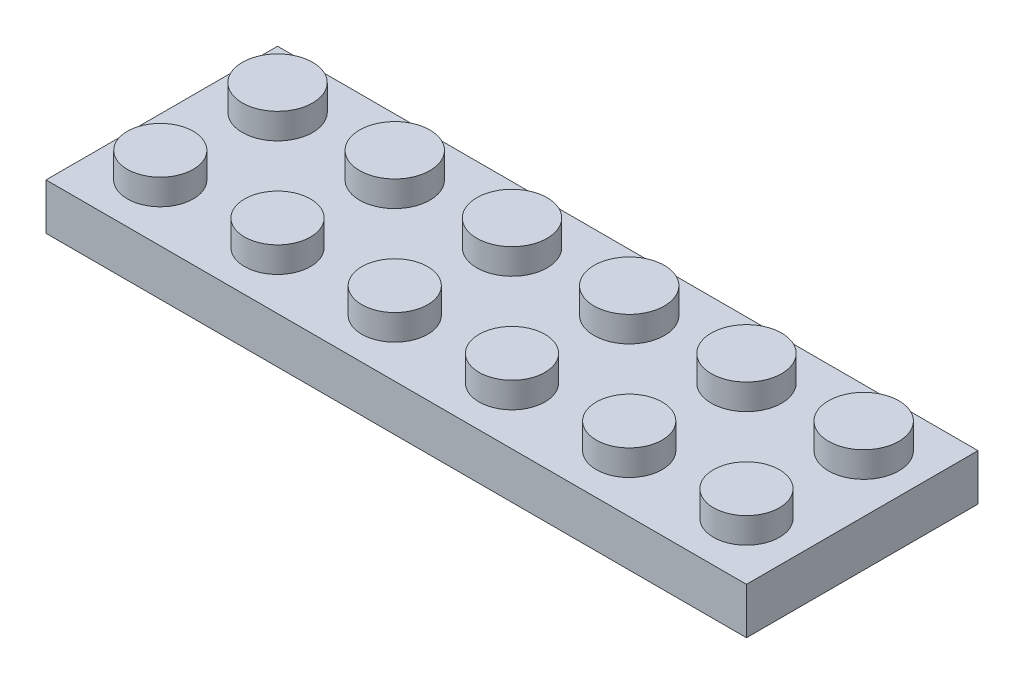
ISO-10303-21;
HEADER;
FILE_DESCRIPTION(('STEP AP214'),'2;1');
FILE_NAME('part.step','',(''),(''),'','','');
FILE_SCHEMA(('AUTOMOTIVE_DESIGN { 1 0 10303 214 1 1 1 1 }'));
ENDSEC;
DATA;
#1=APPLICATION_CONTEXT('core data for automotive mechanical design processes');
#2=APPLICATION_PROTOCOL_DEFINITION('international standard','automotive_design',2000,#1);
#3=PRODUCT_CONTEXT('',#1,'mechanical');
#4=PRODUCT('Part','Part','',(#3));
#5=PRODUCT_RELATED_PRODUCT_CATEGORY('part','',(#4));
#6=PRODUCT_DEFINITION_FORMATION('','',#4);
#7=PRODUCT_DEFINITION_CONTEXT('part definition',#1,'design');
#8=PRODUCT_DEFINITION('design','',#6,#7);
#9=PRODUCT_DEFINITION_SHAPE('','',#8);
#10=(LENGTH_UNIT() NAMED_UNIT(*) SI_UNIT(.MILLI.,.METRE.));
#11=(NAMED_UNIT(*) PLANE_ANGLE_UNIT() SI_UNIT($,.RADIAN.));
#12=(NAMED_UNIT(*) SI_UNIT($,.STERADIAN.) SOLID_ANGLE_UNIT());
#13=UNCERTAINTY_MEASURE_WITH_UNIT(LENGTH_MEASURE(1.E-05),#10,'distance_accuracy_value','');
#14=(GEOMETRIC_REPRESENTATION_CONTEXT(3) GLOBAL_UNCERTAINTY_ASSIGNED_CONTEXT((#13)) GLOBAL_UNIT_ASSIGNED_CONTEXT((#10,
#11,#12)) REPRESENTATION_CONTEXT('',''));
#15=CARTESIAN_POINT('',(0.,0.,0.));
#16=DIRECTION('',(0.,0.,1.));
#17=DIRECTION('',(1.,0.,0.));
#18=AXIS2_PLACEMENT_3D('',#15,#16,#17);
#19=CARTESIAN_POINT('',(-23.4,2.5,7.4));
#20=DIRECTION('',(0.,-1.,0.));
#21=DIRECTION('',(0.,0.,-1.));
#22=AXIS2_PLACEMENT_3D('',#19,#20,#21);
#23=PLANE('',#22);
#24=CARTESIAN_POINT('',(-8.10000000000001,2.5,0.));
#25=DIRECTION('',(0.,-1.,0.));
#26=DIRECTION('',(0.,0.,-1.));
#27=AXIS2_PLACEMENT_3D('',#24,#25,#26);
#28=CIRCLE('',#27,3.4);
#29=CARTESIAN_POINT('',(-8.10000000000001,2.5,-3.4));
#30=VERTEX_POINT('',#29);
#31=EDGE_CURVE('E451',#30,#30,#28,.T.);
#32=ORIENTED_EDGE('',*,*,#31,.F.);
#33=EDGE_LOOP('',(#32));
#34=FACE_BOUND('',#33,.T.);
#35=CARTESIAN_POINT('',(7.89999999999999,2.5,0.));
#36=DIRECTION('',(0.,-1.,0.));
#37=DIRECTION('',(0.,0.,-1.));
#38=AXIS2_PLACEMENT_3D('',#35,#36,#37);
#39=CIRCLE('',#38,3.4);
#40=CARTESIAN_POINT('',(7.89999999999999,2.5,-3.4));
#41=VERTEX_POINT('',#40);
#42=EDGE_CURVE('E416',#41,#41,#39,.T.);
#43=ORIENTED_EDGE('',*,*,#42,.F.);
#44=EDGE_LOOP('',(#43));
#45=FACE_BOUND('',#44,.T.);
#46=DIRECTION('',(0.,0.,-1.));
#47=VECTOR('',#46,1.);
#48=CARTESIAN_POINT('',(-23.4,2.5,-7.4));
#49=LINE('',#48,#47);
#50=CARTESIAN_POINT('',(-23.4,2.5,7.4));
#51=VERTEX_POINT('',#50);
#52=CARTESIAN_POINT('',(-23.4,2.5,-7.4));
#53=VERTEX_POINT('',#52);
#54=EDGE_CURVE('E114',#51,#53,#49,.T.);
#55=ORIENTED_EDGE('',*,*,#54,.T.);
#56=DIRECTION('',(1.,0.,0.));
#57=VECTOR('',#56,1.);
#58=CARTESIAN_POINT('',(23.4,2.5,-7.4));
#59=LINE('',#58,#57);
#60=CARTESIAN_POINT('',(23.4,2.5,-7.4));
#61=VERTEX_POINT('',#60);
#62=EDGE_CURVE('E123',#53,#61,#59,.T.);
#63=ORIENTED_EDGE('',*,*,#62,.T.);
#64=DIRECTION('',(0.,0.,1.));
#65=VECTOR('',#64,1.);
#66=CARTESIAN_POINT('',(23.4,2.5,-7.4));
#67=LINE('',#66,#65);
#68=CARTESIAN_POINT('',(23.4,2.5,7.4));
#69=VERTEX_POINT('',#68);
#70=EDGE_CURVE('E128',#61,#69,#67,.T.);
#71=ORIENTED_EDGE('',*,*,#70,.T.);
#72=DIRECTION('',(-1.,0.,0.));
#73=VECTOR('',#72,1.);
#74=CARTESIAN_POINT('',(23.4,2.5,7.4));
#75=LINE('',#74,#73);
#76=EDGE_CURVE('E120',#69,#51,#75,.T.);
#77=ORIENTED_EDGE('',*,*,#76,.T.);
#78=EDGE_LOOP('',(#55,#63,#71,#77));
#79=FACE_BOUND('',#78,.T.);
#80=CARTESIAN_POINT('',(15.9,2.5,0.));
#81=DIRECTION('',(0.,-1.,0.));
#82=DIRECTION('',(0.,0.,-1.));
#83=AXIS2_PLACEMENT_3D('',#80,#81,#82);
#84=CIRCLE('',#83,3.4);
#85=CARTESIAN_POINT('',(15.9,2.5,-3.4));
#86=VERTEX_POINT('',#85);
#87=EDGE_CURVE('E138',#86,#86,#84,.T.);
#88=ORIENTED_EDGE('',*,*,#87,.F.);
#89=EDGE_LOOP('',(#88));
#90=FACE_BOUND('',#89,.T.);
#91=CARTESIAN_POINT('',(-0.100000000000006,2.5,0.));
#92=DIRECTION('',(0.,-1.,0.));
#93=DIRECTION('',(0.,0.,-1.));
#94=AXIS2_PLACEMENT_3D('',#91,#92,#93);
#95=CIRCLE('',#94,3.4);
#96=CARTESIAN_POINT('',(-0.100000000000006,2.5,-3.4));
#97=VERTEX_POINT('',#96);
#98=EDGE_CURVE('E443',#97,#97,#95,.T.);
#99=ORIENTED_EDGE('',*,*,#98,.F.);
#100=EDGE_LOOP('',(#99));
#101=FACE_BOUND('',#100,.T.);
#102=CARTESIAN_POINT('',(-16.1,2.5,0.));
#103=DIRECTION('',(0.,-1.,0.));
#104=DIRECTION('',(0.,0.,-1.));
#105=AXIS2_PLACEMENT_3D('',#102,#103,#104);
#106=CIRCLE('',#105,3.4);
#107=CARTESIAN_POINT('',(-16.1,2.5,-3.4));
#108=VERTEX_POINT('',#107);
#109=EDGE_CURVE('E446',#108,#108,#106,.T.);
#110=ORIENTED_EDGE('',*,*,#109,.F.);
#111=EDGE_LOOP('',(#110));
#112=FACE_BOUND('',#111,.T.);
#113=ADVANCED_FACE('F37',(#34,#45,#79,#90,#101,#112),#23,.T.);
#114=CARTESIAN_POINT('',(-23.9,3.16,-7.9));
#115=DIRECTION('',(0.,1.,0.));
#116=DIRECTION('',(0.,0.,1.));
#117=AXIS2_PLACEMENT_3D('',#114,#115,#116);
#118=PLANE('',#117);
#119=CARTESIAN_POINT('',(-20.,3.16,4.));
#120=DIRECTION('',(0.,1.,0.));
#121=DIRECTION('',(0.,0.,1.));
#122=AXIS2_PLACEMENT_3D('',#119,#120,#121);
#123=CIRCLE('',#122,2.25);
#124=CARTESIAN_POINT('',(-20.,3.16,6.25));
#125=VERTEX_POINT('',#124);
#126=EDGE_CURVE('E201',#125,#125,#123,.T.);
#127=ORIENTED_EDGE('',*,*,#126,.F.);
#128=EDGE_LOOP('',(#127));
#129=FACE_BOUND('',#128,.T.);
#130=CARTESIAN_POINT('',(-12.,3.16,4.));
#131=DIRECTION('',(0.,1.,0.));
#132=DIRECTION('',(0.,0.,1.));
#133=AXIS2_PLACEMENT_3D('',#130,#131,#132);
#134=CIRCLE('',#133,2.25);
#135=CARTESIAN_POINT('',(-12.,3.16,6.25));
#136=VERTEX_POINT('',#135);
#137=EDGE_CURVE('E195',#136,#136,#134,.T.);
#138=ORIENTED_EDGE('',*,*,#137,.F.);
#139=EDGE_LOOP('',(#138));
#140=FACE_BOUND('',#139,.T.);
#141=CARTESIAN_POINT('',(-4.00000000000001,3.16,4.));
#142=DIRECTION('',(0.,1.,0.));
#143=DIRECTION('',(0.,0.,1.));
#144=AXIS2_PLACEMENT_3D('',#141,#142,#143);
#145=CIRCLE('',#144,2.25);
#146=CARTESIAN_POINT('',(-4.00000000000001,3.16,6.25));
#147=VERTEX_POINT('',#146);
#148=EDGE_CURVE('E189',#147,#147,#145,.T.);
#149=ORIENTED_EDGE('',*,*,#148,.F.);
#150=EDGE_LOOP('',(#149));
#151=FACE_BOUND('',#150,.T.);
#152=CARTESIAN_POINT('',(3.99999999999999,3.16,4.));
#153=DIRECTION('',(0.,1.,0.));
#154=DIRECTION('',(0.,0.,1.));
#155=AXIS2_PLACEMENT_3D('',#152,#153,#154);
#156=CIRCLE('',#155,2.25);
#157=CARTESIAN_POINT('',(3.99999999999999,3.16,6.25));
#158=VERTEX_POINT('',#157);
#159=EDGE_CURVE('E414',#158,#158,#156,.T.);
#160=ORIENTED_EDGE('',*,*,#159,.F.);
#161=EDGE_LOOP('',(#160));
#162=FACE_BOUND('',#161,.T.);
#163=CARTESIAN_POINT('',(20.,3.16,4.));
#164=DIRECTION('',(0.,1.,0.));
#165=DIRECTION('',(0.,0.,1.));
#166=AXIS2_PLACEMENT_3D('',#163,#164,#165);
#167=CIRCLE('',#166,2.25);
#168=CARTESIAN_POINT('',(20.,3.16,6.25));
#169=VERTEX_POINT('',#168);
#170=EDGE_CURVE('E429',#169,#169,#167,.T.);
#171=ORIENTED_EDGE('',*,*,#170,.F.);
#172=EDGE_LOOP('',(#171));
#173=FACE_BOUND('',#172,.T.);
#174=CARTESIAN_POINT('',(12.,3.16,-4.));
#175=DIRECTION('',(0.,1.,0.));
#176=DIRECTION('',(0.,0.,1.));
#177=AXIS2_PLACEMENT_3D('',#174,#175,#176);
#178=CIRCLE('',#177,2.40018816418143);
#179=CARTESIAN_POINT('',(12.,3.16,-1.59981183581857));
#180=VERTEX_POINT('',#179);
#181=EDGE_CURVE('E158',#180,#180,#178,.T.);
#182=ORIENTED_EDGE('',*,*,#181,.F.);
#183=EDGE_LOOP('',(#182));
#184=FACE_BOUND('',#183,.T.);
#185=DIRECTION('',(0.,0.,1.));
#186=VECTOR('',#185,1.);
#187=CARTESIAN_POINT('',(-23.9,3.16,7.9));
#188=LINE('',#187,#186);
#189=CARTESIAN_POINT('',(-23.9,3.16,-7.9));
#190=VERTEX_POINT('',#189);
#191=CARTESIAN_POINT('',(-23.9,3.16,7.9));
#192=VERTEX_POINT('',#191);
#193=EDGE_CURVE('E167',#190,#192,#188,.T.);
#194=ORIENTED_EDGE('',*,*,#193,.T.);
#195=DIRECTION('',(1.,0.,0.));
#196=VECTOR('',#195,1.);
#197=CARTESIAN_POINT('',(23.9,3.16,7.9));
#198=LINE('',#197,#196);
#199=CARTESIAN_POINT('',(23.9,3.16,7.9));
#200=VERTEX_POINT('',#199);
#201=EDGE_CURVE('E90',#192,#200,#198,.T.);
#202=ORIENTED_EDGE('',*,*,#201,.T.);
#203=DIRECTION('',(0.,0.,-1.));
#204=VECTOR('',#203,1.);
#205=CARTESIAN_POINT('',(23.9,3.16,7.9));
#206=LINE('',#205,#204);
#207=CARTESIAN_POINT('',(23.9,3.16,-7.9));
#208=VERTEX_POINT('',#207);
#209=EDGE_CURVE('E170',#200,#208,#206,.T.);
#210=ORIENTED_EDGE('',*,*,#209,.T.);
#211=DIRECTION('',(-1.,0.,0.));
#212=VECTOR('',#211,1.);
#213=CARTESIAN_POINT('',(23.9,3.16,-7.9));
#214=LINE('',#213,#212);
#215=EDGE_CURVE('E61',#208,#190,#214,.T.);
#216=ORIENTED_EDGE('',*,*,#215,.T.);
#217=EDGE_LOOP('',(#194,#202,#210,#216));
#218=FACE_BOUND('',#217,.T.);
#219=CARTESIAN_POINT('',(12.,3.16,4.));
#220=DIRECTION('',(0.,1.,0.));
#221=DIRECTION('',(0.,0.,1.));
#222=AXIS2_PLACEMENT_3D('',#219,#220,#221);
#223=CIRCLE('',#222,2.25);
#224=CARTESIAN_POINT('',(12.,3.16,6.25));
#225=VERTEX_POINT('',#224);
#226=EDGE_CURVE('E151',#225,#225,#223,.T.);
#227=ORIENTED_EDGE('',*,*,#226,.F.);
#228=EDGE_LOOP('',(#227));
#229=FACE_BOUND('',#228,.T.);
#230=CARTESIAN_POINT('',(20.,3.16,-4.));
#231=DIRECTION('',(0.,1.,0.));
#232=DIRECTION('',(0.,0.,1.));
#233=AXIS2_PLACEMENT_3D('',#230,#231,#232);
#234=CIRCLE('',#233,2.40018816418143);
#235=CARTESIAN_POINT('',(20.,3.16,-1.59981183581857));
#236=VERTEX_POINT('',#235);
#237=EDGE_CURVE('E399',#236,#236,#234,.T.);
#238=ORIENTED_EDGE('',*,*,#237,.F.);
#239=EDGE_LOOP('',(#238));
#240=FACE_BOUND('',#239,.T.);
#241=CARTESIAN_POINT('',(3.99999999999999,3.16,-4.));
#242=DIRECTION('',(0.,1.,0.));
#243=DIRECTION('',(0.,0.,1.));
#244=AXIS2_PLACEMENT_3D('',#241,#242,#243);
#245=CIRCLE('',#244,2.40018816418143);
#246=CARTESIAN_POINT('',(3.99999999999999,3.16,-1.59981183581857));
#247=VERTEX_POINT('',#246);
#248=EDGE_CURVE('E403',#247,#247,#245,.T.);
#249=ORIENTED_EDGE('',*,*,#248,.F.);
#250=EDGE_LOOP('',(#249));
#251=FACE_BOUND('',#250,.T.);
#252=CARTESIAN_POINT('',(-4.00000000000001,3.16,-4.));
#253=DIRECTION('',(0.,1.,0.));
#254=DIRECTION('',(0.,0.,1.));
#255=AXIS2_PLACEMENT_3D('',#252,#253,#254);
#256=CIRCLE('',#255,2.40018816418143);
#257=CARTESIAN_POINT('',(-4.00000000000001,3.16,-1.59981183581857));
#258=VERTEX_POINT('',#257);
#259=EDGE_CURVE('E207',#258,#258,#256,.T.);
#260=ORIENTED_EDGE('',*,*,#259,.F.);
#261=EDGE_LOOP('',(#260));
#262=FACE_BOUND('',#261,.T.);
#263=CARTESIAN_POINT('',(-12.,3.16,-4.));
#264=DIRECTION('',(0.,1.,0.));
#265=DIRECTION('',(0.,0.,1.));
#266=AXIS2_PLACEMENT_3D('',#263,#264,#265);
#267=CIRCLE('',#266,2.40018816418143);
#268=CARTESIAN_POINT('',(-12.,3.16,-1.59981183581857));
#269=VERTEX_POINT('',#268);
#270=EDGE_CURVE('E213',#269,#269,#267,.T.);
#271=ORIENTED_EDGE('',*,*,#270,.F.);
#272=EDGE_LOOP('',(#271));
#273=FACE_BOUND('',#272,.T.);
#274=CARTESIAN_POINT('',(-20.,3.16,-4.));
#275=DIRECTION('',(0.,1.,0.));
#276=DIRECTION('',(0.,0.,1.));
#277=AXIS2_PLACEMENT_3D('',#274,#275,#276);
#278=CIRCLE('',#277,2.40018816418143);
#279=CARTESIAN_POINT('',(-20.,3.16,-1.59981183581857));
#280=VERTEX_POINT('',#279);
#281=EDGE_CURVE('E45',#280,#280,#278,.T.);
#282=ORIENTED_EDGE('',*,*,#281,.F.);
#283=EDGE_LOOP('',(#282));
#284=FACE_BOUND('',#283,.T.);
#285=ADVANCED_FACE('F223',(#129,#140,#151,#162,#173,#184,#218,#229,#240,#251,#262,#273,#284),
#118,.T.);
#286=CARTESIAN_POINT('',(-23.9,3.16,7.9));
#287=DIRECTION('',(1.,0.,0.));
#288=DIRECTION('',(0.,0.,-1.));
#289=AXIS2_PLACEMENT_3D('',#286,#287,#288);
#290=PLANE('',#289);
#291=DIRECTION('',(0.,0.,1.));
#292=VECTOR('',#291,1.);
#293=CARTESIAN_POINT('',(-23.9,0.,7.9));
#294=LINE('',#293,#292);
#295=CARTESIAN_POINT('',(-23.9,0.,-7.9));
#296=VERTEX_POINT('',#295);
#297=CARTESIAN_POINT('',(-23.9,0.,7.9));
#298=VERTEX_POINT('',#297);
#299=EDGE_CURVE('E164',#296,#298,#294,.T.);
#300=ORIENTED_EDGE('',*,*,#299,.T.);
#301=DIRECTION('',(0.,-1.,0.));
#302=VECTOR('',#301,1.);
#303=CARTESIAN_POINT('',(-23.9,3.16,7.9));
#304=LINE('',#303,#302);
#305=EDGE_CURVE('E187',#192,#298,#304,.T.);
#306=ORIENTED_EDGE('',*,*,#305,.F.);
#307=ORIENTED_EDGE('',*,*,#193,.F.);
#308=DIRECTION('',(0.,-1.,0.));
#309=VECTOR('',#308,1.);
#310=CARTESIAN_POINT('',(-23.9,3.16,-7.9));
#311=LINE('',#310,#309);
#312=EDGE_CURVE('E173',#190,#296,#311,.T.);
#313=ORIENTED_EDGE('',*,*,#312,.T.);
#314=EDGE_LOOP('',(#300,#306,#307,#313));
#315=FACE_BOUND('',#314,.T.);
#316=ADVANCED_FACE('F225',(#315),#290,.F.);
#317=CARTESIAN_POINT('',(23.9,3.16,7.9));
#318=DIRECTION('',(0.,0.,-1.));
#319=DIRECTION('',(-1.,0.,0.));
#320=AXIS2_PLACEMENT_3D('',#317,#318,#319);
#321=PLANE('',#320);
#322=DIRECTION('',(1.,0.,0.));
#323=VECTOR('',#322,1.);
#324=CARTESIAN_POINT('',(23.9,0.,7.9));
#325=LINE('',#324,#323);
#326=CARTESIAN_POINT('',(23.9,0.,7.9));
#327=VERTEX_POINT('',#326);
#328=EDGE_CURVE('E176',#298,#327,#325,.T.);
#329=ORIENTED_EDGE('',*,*,#328,.T.);
#330=DIRECTION('',(0.,-1.,0.));
#331=VECTOR('',#330,1.);
#332=CARTESIAN_POINT('',(23.9,3.16,7.9));
#333=LINE('',#332,#331);
#334=EDGE_CURVE('E184',#200,#327,#333,.T.);
#335=ORIENTED_EDGE('',*,*,#334,.F.);
#336=ORIENTED_EDGE('',*,*,#201,.F.);
#337=ORIENTED_EDGE('',*,*,#305,.T.);
#338=EDGE_LOOP('',(#329,#335,#336,#337));
#339=FACE_BOUND('',#338,.T.);
#340=ADVANCED_FACE('F232',(#339),#321,.F.);
#341=CARTESIAN_POINT('',(23.9,3.16,7.9));
#342=DIRECTION('',(-1.,0.,0.));
#343=DIRECTION('',(0.,0.,1.));
#344=AXIS2_PLACEMENT_3D('',#341,#342,#343);
#345=PLANE('',#344);
#346=DIRECTION('',(0.,0.,-1.));
#347=VECTOR('',#346,1.);
#348=CARTESIAN_POINT('',(23.9,0.,7.9));
#349=LINE('',#348,#347);
#350=CARTESIAN_POINT('',(23.9,0.,-7.9));
#351=VERTEX_POINT('',#350);
#352=EDGE_CURVE('E178',#327,#351,#349,.T.);
#353=ORIENTED_EDGE('',*,*,#352,.T.);
#354=DIRECTION('',(0.,-1.,0.));
#355=VECTOR('',#354,1.);
#356=CARTESIAN_POINT('',(23.9,3.16,-7.9));
#357=LINE('',#356,#355);
#358=EDGE_CURVE('E182',#208,#351,#357,.T.);
#359=ORIENTED_EDGE('',*,*,#358,.F.);
#360=ORIENTED_EDGE('',*,*,#209,.F.);
#361=ORIENTED_EDGE('',*,*,#334,.T.);
#362=EDGE_LOOP('',(#353,#359,#360,#361));
#363=FACE_BOUND('',#362,.T.);
#364=ADVANCED_FACE('F250',(#363),#345,.F.);
#365=CARTESIAN_POINT('',(23.9,3.16,-7.9));
#366=DIRECTION('',(0.,0.,1.));
#367=DIRECTION('',(1.,0.,0.));
#368=AXIS2_PLACEMENT_3D('',#365,#366,#367);
#369=PLANE('',#368);
#370=DIRECTION('',(-1.,0.,0.));
#371=VECTOR('',#370,1.);
#372=CARTESIAN_POINT('',(23.9,0.,-7.9));
#373=LINE('',#372,#371);
#374=EDGE_CURVE('E82',#351,#296,#373,.T.);
#375=ORIENTED_EDGE('',*,*,#374,.T.);
#376=ORIENTED_EDGE('',*,*,#312,.F.);
#377=ORIENTED_EDGE('',*,*,#215,.F.);
#378=ORIENTED_EDGE('',*,*,#358,.T.);
#379=EDGE_LOOP('',(#375,#376,#377,#378));
#380=FACE_BOUND('',#379,.T.);
#381=ADVANCED_FACE('F246',(#380),#369,.F.);
#382=CARTESIAN_POINT('',(-23.9,0.,-7.9));
#383=DIRECTION('',(0.,1.,0.));
#384=DIRECTION('',(0.,0.,1.));
#385=AXIS2_PLACEMENT_3D('',#382,#383,#384);
#386=PLANE('',#385);
#387=DIRECTION('',(1.,0.,0.));
#388=VECTOR('',#387,1.);
#389=CARTESIAN_POINT('',(23.4,0.,-7.4));
#390=LINE('',#389,#388);
#391=CARTESIAN_POINT('',(-23.4,0.,-7.4));
#392=VERTEX_POINT('',#391);
#393=CARTESIAN_POINT('',(23.4,0.,-7.4));
#394=VERTEX_POINT('',#393);
#395=EDGE_CURVE('E144',#392,#394,#390,.T.);
#396=ORIENTED_EDGE('',*,*,#395,.F.);
#397=DIRECTION('',(0.,0.,-1.));
#398=VECTOR('',#397,1.);
#399=CARTESIAN_POINT('',(-23.4,0.,-7.4));
#400=LINE('',#399,#398);
#401=CARTESIAN_POINT('',(-23.4,0.,7.4));
#402=VERTEX_POINT('',#401);
#403=EDGE_CURVE('E52',#402,#392,#400,.T.);
#404=ORIENTED_EDGE('',*,*,#403,.F.);
#405=DIRECTION('',(-1.,0.,0.));
#406=VECTOR('',#405,1.);
#407=CARTESIAN_POINT('',(23.4,0.,7.4));
#408=LINE('',#407,#406);
#409=CARTESIAN_POINT('',(23.4,0.,7.4));
#410=VERTEX_POINT('',#409);
#411=EDGE_CURVE('E132',#410,#402,#408,.T.);
#412=ORIENTED_EDGE('',*,*,#411,.F.);
#413=DIRECTION('',(0.,0.,1.));
#414=VECTOR('',#413,1.);
#415=CARTESIAN_POINT('',(23.4,0.,-7.4));
#416=LINE('',#415,#414);
#417=EDGE_CURVE('E135',#394,#410,#416,.T.);
#418=ORIENTED_EDGE('',*,*,#417,.F.);
#419=EDGE_LOOP('',(#396,#404,#412,#418));
#420=FACE_BOUND('',#419,.T.);
#421=ORIENTED_EDGE('',*,*,#299,.F.);
#422=ORIENTED_EDGE('',*,*,#374,.F.);
#423=ORIENTED_EDGE('',*,*,#352,.F.);
#424=ORIENTED_EDGE('',*,*,#328,.F.);
#425=EDGE_LOOP('',(#421,#422,#423,#424));
#426=FACE_BOUND('',#425,.T.);
#427=ADVANCED_FACE('F243',(#420,#426),#386,.F.);
#428=CARTESIAN_POINT('',(12.,4.91,-4.));
#429=DIRECTION('',(0.,-1.,0.));
#430=DIRECTION('',(0.,0.,-1.));
#431=AXIS2_PLACEMENT_3D('',#428,#429,#430);
#432=CYLINDRICAL_SURFACE('',#431,2.40018816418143);
#433=CARTESIAN_POINT('',(12.,4.91,-4.));
#434=DIRECTION('',(0.,1.,0.));
#435=DIRECTION('',(0.,0.,1.));
#436=AXIS2_PLACEMENT_3D('',#433,#434,#435);
#437=CIRCLE('',#436,2.40018816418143);
#438=CARTESIAN_POINT('',(12.,4.91,-1.59981183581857));
#439=VERTEX_POINT('',#438);
#440=EDGE_CURVE('E161',#439,#439,#437,.T.);
#441=ORIENTED_EDGE('',*,*,#440,.F.);
#442=EDGE_LOOP('',(#441));
#443=FACE_BOUND('',#442,.T.);
#444=ORIENTED_EDGE('',*,*,#181,.T.);
#445=EDGE_LOOP('',(#444));
#446=FACE_BOUND('',#445,.T.);
#447=ADVANCED_FACE('F241',(#443,#446),#432,.T.);
#448=CARTESIAN_POINT('',(12.,4.91,-4.));
#449=DIRECTION('',(0.,1.,0.));
#450=DIRECTION('',(0.,0.,1.));
#451=AXIS2_PLACEMENT_3D('',#448,#449,#450);
#452=PLANE('',#451);
#453=ORIENTED_EDGE('',*,*,#440,.T.);
#454=EDGE_LOOP('',(#453));
#455=FACE_BOUND('',#454,.T.);
#456=ADVANCED_FACE('F379',(#455),#452,.T.);
#457=CARTESIAN_POINT('',(12.,4.91,4.));
#458=DIRECTION('',(0.,-1.,0.));
#459=DIRECTION('',(0.,0.,-1.));
#460=AXIS2_PLACEMENT_3D('',#457,#458,#459);
#461=CYLINDRICAL_SURFACE('',#460,2.25);
#462=CARTESIAN_POINT('',(12.,4.91,4.));
#463=DIRECTION('',(0.,1.,0.));
#464=DIRECTION('',(0.,0.,1.));
#465=AXIS2_PLACEMENT_3D('',#462,#463,#464);
#466=CIRCLE('',#465,2.25);
#467=CARTESIAN_POINT('',(12.,4.91,6.25));
#468=VERTEX_POINT('',#467);
#469=EDGE_CURVE('E155',#468,#468,#466,.T.);
#470=ORIENTED_EDGE('',*,*,#469,.F.);
#471=EDGE_LOOP('',(#470));
#472=FACE_BOUND('',#471,.T.);
#473=ORIENTED_EDGE('',*,*,#226,.T.);
#474=EDGE_LOOP('',(#473));
#475=FACE_BOUND('',#474,.T.);
#476=ADVANCED_FACE('F376',(#472,#475),#461,.T.);
#477=CARTESIAN_POINT('',(12.,4.91,4.));
#478=DIRECTION('',(0.,1.,0.));
#479=DIRECTION('',(0.,0.,1.));
#480=AXIS2_PLACEMENT_3D('',#477,#478,#479);
#481=PLANE('',#480);
#482=ORIENTED_EDGE('',*,*,#469,.T.);
#483=EDGE_LOOP('',(#482));
#484=FACE_BOUND('',#483,.T.);
#485=ADVANCED_FACE('F373',(#484),#481,.T.);
#486=CARTESIAN_POINT('',(-23.4,2.5,-7.4));
#487=DIRECTION('',(-1.,0.,0.));
#488=DIRECTION('',(0.,0.,1.));
#489=AXIS2_PLACEMENT_3D('',#486,#487,#488);
#490=PLANE('',#489);
#491=ORIENTED_EDGE('',*,*,#403,.T.);
#492=DIRECTION('',(0.,-1.,0.));
#493=VECTOR('',#492,1.);
#494=CARTESIAN_POINT('',(-23.4,2.5,-7.4));
#495=LINE('',#494,#493);
#496=EDGE_CURVE('E110',#53,#392,#495,.T.);
#497=ORIENTED_EDGE('',*,*,#496,.F.);
#498=ORIENTED_EDGE('',*,*,#54,.F.);
#499=DIRECTION('',(0.,-1.,0.));
#500=VECTOR('',#499,1.);
#501=CARTESIAN_POINT('',(-23.4,2.5,7.4));
#502=LINE('',#501,#500);
#503=EDGE_CURVE('E149',#51,#402,#502,.T.);
#504=ORIENTED_EDGE('',*,*,#503,.T.);
#505=EDGE_LOOP('',(#491,#497,#498,#504));
#506=FACE_BOUND('',#505,.T.);
#507=ADVANCED_FACE('F112',(#506),#490,.F.);
#508=CARTESIAN_POINT('',(23.4,2.5,7.4));
#509=DIRECTION('',(0.,0.,1.));
#510=DIRECTION('',(1.,0.,0.));
#511=AXIS2_PLACEMENT_3D('',#508,#509,#510);
#512=PLANE('',#511);
#513=ORIENTED_EDGE('',*,*,#411,.T.);
#514=ORIENTED_EDGE('',*,*,#503,.F.);
#515=ORIENTED_EDGE('',*,*,#76,.F.);
#516=DIRECTION('',(0.,-1.,0.));
#517=VECTOR('',#516,1.);
#518=CARTESIAN_POINT('',(23.4,2.5,7.4));
#519=LINE('',#518,#517);
#520=EDGE_CURVE('E152',#69,#410,#519,.T.);
#521=ORIENTED_EDGE('',*,*,#520,.T.);
#522=EDGE_LOOP('',(#513,#514,#515,#521));
#523=FACE_BOUND('',#522,.T.);
#524=ADVANCED_FACE('F361',(#523),#512,.F.);
#525=CARTESIAN_POINT('',(23.4,2.5,-7.4));
#526=DIRECTION('',(1.,0.,0.));
#527=DIRECTION('',(0.,0.,-1.));
#528=AXIS2_PLACEMENT_3D('',#525,#526,#527);
#529=PLANE('',#528);
#530=ORIENTED_EDGE('',*,*,#417,.T.);
#531=ORIENTED_EDGE('',*,*,#520,.F.);
#532=ORIENTED_EDGE('',*,*,#70,.F.);
#533=DIRECTION('',(0.,-1.,0.));
#534=VECTOR('',#533,1.);
#535=CARTESIAN_POINT('',(23.4,2.5,-7.4));
#536=LINE('',#535,#534);
#537=EDGE_CURVE('E119',#61,#394,#536,.T.);
#538=ORIENTED_EDGE('',*,*,#537,.T.);
#539=EDGE_LOOP('',(#530,#531,#532,#538));
#540=FACE_BOUND('',#539,.T.);
#541=ADVANCED_FACE('F364',(#540),#529,.F.);
#542=CARTESIAN_POINT('',(23.4,2.5,-7.4));
#543=DIRECTION('',(0.,0.,-1.));
#544=DIRECTION('',(-1.,0.,0.));
#545=AXIS2_PLACEMENT_3D('',#542,#543,#544);
#546=PLANE('',#545);
#547=ORIENTED_EDGE('',*,*,#395,.T.);
#548=ORIENTED_EDGE('',*,*,#537,.F.);
#549=ORIENTED_EDGE('',*,*,#62,.F.);
#550=ORIENTED_EDGE('',*,*,#496,.T.);
#551=EDGE_LOOP('',(#547,#548,#549,#550));
#552=FACE_BOUND('',#551,.T.);
#553=ADVANCED_FACE('F124',(#552),#546,.F.);
#554=CARTESIAN_POINT('',(15.9,0.,0.));
#555=DIRECTION('',(0.,1.,0.));
#556=DIRECTION('',(0.,0.,1.));
#557=AXIS2_PLACEMENT_3D('',#554,#555,#556);
#558=CYLINDRICAL_SURFACE('',#557,3.4);
#559=CARTESIAN_POINT('',(15.9,0.,0.));
#560=DIRECTION('',(0.,-1.,0.));
#561=DIRECTION('',(0.,0.,-1.));
#562=AXIS2_PLACEMENT_3D('',#559,#560,#561);
#563=CIRCLE('',#562,3.4);
#564=CARTESIAN_POINT('',(15.9,0.,-3.4));
#565=VERTEX_POINT('',#564);
#566=EDGE_CURVE('E145',#565,#565,#563,.T.);
#567=ORIENTED_EDGE('',*,*,#566,.F.);
#568=EDGE_LOOP('',(#567));
#569=FACE_BOUND('',#568,.T.);
#570=ORIENTED_EDGE('',*,*,#87,.T.);
#571=EDGE_LOOP('',(#570));
#572=FACE_BOUND('',#571,.T.);
#573=ADVANCED_FACE('F356',(#569,#572),#558,.T.);
#574=CARTESIAN_POINT('',(15.9,0.,0.));
#575=DIRECTION('',(0.,-1.,0.));
#576=DIRECTION('',(0.,0.,-1.));
#577=AXIS2_PLACEMENT_3D('',#574,#575,#576);
#578=PLANE('',#577);
#579=ORIENTED_EDGE('',*,*,#566,.T.);
#580=EDGE_LOOP('',(#579));
#581=FACE_BOUND('',#580,.T.);
#582=ADVANCED_FACE('F350',(#581),#578,.T.);
#583=CARTESIAN_POINT('',(20.,4.91,4.));
#584=DIRECTION('',(0.,-1.,0.));
#585=DIRECTION('',(0.,0.,-1.));
#586=AXIS2_PLACEMENT_3D('',#583,#584,#585);
#587=CYLINDRICAL_SURFACE('',#586,2.25);
#588=CARTESIAN_POINT('',(20.,4.91,4.));
#589=DIRECTION('',(0.,1.,0.));
#590=DIRECTION('',(0.,0.,1.));
#591=AXIS2_PLACEMENT_3D('',#588,#589,#590);
#592=CIRCLE('',#591,2.25);
#593=CARTESIAN_POINT('',(20.,4.91,6.25));
#594=VERTEX_POINT('',#593);
#595=EDGE_CURVE('E432',#594,#594,#592,.T.);
#596=ORIENTED_EDGE('',*,*,#595,.F.);
#597=EDGE_LOOP('',(#596));
#598=FACE_BOUND('',#597,.T.);
#599=ORIENTED_EDGE('',*,*,#170,.T.);
#600=EDGE_LOOP('',(#599));
#601=FACE_BOUND('',#600,.T.);
#602=ADVANCED_FACE('F342',(#598,#601),#587,.T.);
#603=CARTESIAN_POINT('',(20.,4.91,4.));
#604=DIRECTION('',(0.,1.,0.));
#605=DIRECTION('',(0.,0.,1.));
#606=AXIS2_PLACEMENT_3D('',#603,#604,#605);
#607=PLANE('',#606);
#608=ORIENTED_EDGE('',*,*,#595,.T.);
#609=EDGE_LOOP('',(#608));
#610=FACE_BOUND('',#609,.T.);
#611=ADVANCED_FACE('F345',(#610),#607,.T.);
#612=CARTESIAN_POINT('',(20.,4.91,-4.));
#613=DIRECTION('',(0.,-1.,0.));
#614=DIRECTION('',(0.,0.,-1.));
#615=AXIS2_PLACEMENT_3D('',#612,#613,#614);
#616=CYLINDRICAL_SURFACE('',#615,2.40018816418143);
#617=CARTESIAN_POINT('',(20.,4.91,-4.));
#618=DIRECTION('',(0.,1.,0.));
#619=DIRECTION('',(0.,0.,1.));
#620=AXIS2_PLACEMENT_3D('',#617,#618,#619);
#621=CIRCLE('',#620,2.40018816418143);
#622=CARTESIAN_POINT('',(20.,4.91,-1.59981183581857));
#623=VERTEX_POINT('',#622);
#624=EDGE_CURVE('E426',#623,#623,#621,.T.);
#625=ORIENTED_EDGE('',*,*,#624,.F.);
#626=EDGE_LOOP('',(#625));
#627=FACE_BOUND('',#626,.T.);
#628=ORIENTED_EDGE('',*,*,#237,.T.);
#629=EDGE_LOOP('',(#628));
#630=FACE_BOUND('',#629,.T.);
#631=ADVANCED_FACE('F334',(#627,#630),#616,.T.);
#632=CARTESIAN_POINT('',(20.,4.91,-4.));
#633=DIRECTION('',(0.,1.,0.));
#634=DIRECTION('',(0.,0.,1.));
#635=AXIS2_PLACEMENT_3D('',#632,#633,#634);
#636=PLANE('',#635);
#637=ORIENTED_EDGE('',*,*,#624,.T.);
#638=EDGE_LOOP('',(#637));
#639=FACE_BOUND('',#638,.T.);
#640=ADVANCED_FACE('F337',(#639),#636,.T.);
#641=CARTESIAN_POINT('',(3.99999999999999,4.91,4.));
#642=DIRECTION('',(0.,-1.,0.));
#643=DIRECTION('',(0.,0.,-1.));
#644=AXIS2_PLACEMENT_3D('',#641,#642,#643);
#645=CYLINDRICAL_SURFACE('',#644,2.25);
#646=CARTESIAN_POINT('',(3.99999999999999,4.91,4.));
#647=DIRECTION('',(0.,1.,0.));
#648=DIRECTION('',(0.,0.,1.));
#649=AXIS2_PLACEMENT_3D('',#646,#647,#648);
#650=CIRCLE('',#649,2.25);
#651=CARTESIAN_POINT('',(3.99999999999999,4.91,6.25));
#652=VERTEX_POINT('',#651);
#653=EDGE_CURVE('E422',#652,#652,#650,.T.);
#654=ORIENTED_EDGE('',*,*,#653,.F.);
#655=EDGE_LOOP('',(#654));
#656=FACE_BOUND('',#655,.T.);
#657=ORIENTED_EDGE('',*,*,#159,.T.);
#658=EDGE_LOOP('',(#657));
#659=FACE_BOUND('',#658,.T.);
#660=ADVANCED_FACE('F266',(#656,#659),#645,.T.);
#661=CARTESIAN_POINT('',(3.99999999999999,4.91,4.));
#662=DIRECTION('',(0.,1.,0.));
#663=DIRECTION('',(0.,0.,1.));
#664=AXIS2_PLACEMENT_3D('',#661,#662,#663);
#665=PLANE('',#664);
#666=ORIENTED_EDGE('',*,*,#653,.T.);
#667=EDGE_LOOP('',(#666));
#668=FACE_BOUND('',#667,.T.);
#669=ADVANCED_FACE('F264',(#668),#665,.T.);
#670=CARTESIAN_POINT('',(-4.00000000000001,4.91,4.));
#671=DIRECTION('',(0.,1.,0.));
#672=DIRECTION('',(0.,0.,1.));
#673=AXIS2_PLACEMENT_3D('',#670,#671,#672);
#674=PLANE('',#673);
#675=CARTESIAN_POINT('',(-4.00000000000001,4.91,4.));
#676=DIRECTION('',(0.,1.,0.));
#677=DIRECTION('',(0.,0.,1.));
#678=AXIS2_PLACEMENT_3D('',#675,#676,#677);
#679=CIRCLE('',#678,2.25);
#680=CARTESIAN_POINT('',(-4.00000000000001,4.91,6.25));
#681=VERTEX_POINT('',#680);
#682=EDGE_CURVE('E192',#681,#681,#679,.T.);
#683=ORIENTED_EDGE('',*,*,#682,.T.);
#684=EDGE_LOOP('',(#683));
#685=FACE_BOUND('',#684,.T.);
#686=ADVANCED_FACE('F260',(#685),#674,.T.);
#687=CARTESIAN_POINT('',(-4.00000000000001,4.91,4.));
#688=DIRECTION('',(0.,-1.,0.));
#689=DIRECTION('',(0.,0.,-1.));
#690=AXIS2_PLACEMENT_3D('',#687,#688,#689);
#691=CYLINDRICAL_SURFACE('',#690,2.25);
#692=ORIENTED_EDGE('',*,*,#682,.F.);
#693=EDGE_LOOP('',(#692));
#694=FACE_BOUND('',#693,.T.);
#695=ORIENTED_EDGE('',*,*,#148,.T.);
#696=EDGE_LOOP('',(#695));
#697=FACE_BOUND('',#696,.T.);
#698=ADVANCED_FACE('F256',(#694,#697),#691,.T.);
#699=CARTESIAN_POINT('',(-12.,4.91,4.));
#700=DIRECTION('',(0.,1.,0.));
#701=DIRECTION('',(0.,0.,1.));
#702=AXIS2_PLACEMENT_3D('',#699,#700,#701);
#703=PLANE('',#702);
#704=CARTESIAN_POINT('',(-12.,4.91,4.));
#705=DIRECTION('',(0.,1.,0.));
#706=DIRECTION('',(0.,0.,1.));
#707=AXIS2_PLACEMENT_3D('',#704,#705,#706);
#708=CIRCLE('',#707,2.25);
#709=CARTESIAN_POINT('',(-12.,4.91,6.25));
#710=VERTEX_POINT('',#709);
#711=EDGE_CURVE('E198',#710,#710,#708,.T.);
#712=ORIENTED_EDGE('',*,*,#711,.T.);
#713=EDGE_LOOP('',(#712));
#714=FACE_BOUND('',#713,.T.);
#715=ADVANCED_FACE('F259',(#714),#703,.T.);
#716=CARTESIAN_POINT('',(-12.,4.91,4.));
#717=DIRECTION('',(0.,-1.,0.));
#718=DIRECTION('',(0.,0.,-1.));
#719=AXIS2_PLACEMENT_3D('',#716,#717,#718);
#720=CYLINDRICAL_SURFACE('',#719,2.25);
#721=ORIENTED_EDGE('',*,*,#711,.F.);
#722=EDGE_LOOP('',(#721));
#723=FACE_BOUND('',#722,.T.);
#724=ORIENTED_EDGE('',*,*,#137,.T.);
#725=EDGE_LOOP('',(#724));
#726=FACE_BOUND('',#725,.T.);
#727=ADVANCED_FACE('F267',(#723,#726),#720,.T.);
#728=CARTESIAN_POINT('',(-20.,4.91,4.));
#729=DIRECTION('',(0.,1.,0.));
#730=DIRECTION('',(0.,0.,1.));
#731=AXIS2_PLACEMENT_3D('',#728,#729,#730);
#732=PLANE('',#731);
#733=CARTESIAN_POINT('',(-20.,4.91,4.));
#734=DIRECTION('',(0.,1.,0.));
#735=DIRECTION('',(0.,0.,1.));
#736=AXIS2_PLACEMENT_3D('',#733,#734,#735);
#737=CIRCLE('',#736,2.25);
#738=CARTESIAN_POINT('',(-20.,4.91,6.25));
#739=VERTEX_POINT('',#738);
#740=EDGE_CURVE('E204',#739,#739,#737,.T.);
#741=ORIENTED_EDGE('',*,*,#740,.T.);
#742=EDGE_LOOP('',(#741));
#743=FACE_BOUND('',#742,.T.);
#744=ADVANCED_FACE('F270',(#743),#732,.T.);
#745=CARTESIAN_POINT('',(-20.,4.91,4.));
#746=DIRECTION('',(0.,-1.,0.));
#747=DIRECTION('',(0.,0.,-1.));
#748=AXIS2_PLACEMENT_3D('',#745,#746,#747);
#749=CYLINDRICAL_SURFACE('',#748,2.25);
#750=ORIENTED_EDGE('',*,*,#740,.F.);
#751=EDGE_LOOP('',(#750));
#752=FACE_BOUND('',#751,.T.);
#753=ORIENTED_EDGE('',*,*,#126,.T.);
#754=EDGE_LOOP('',(#753));
#755=FACE_BOUND('',#754,.T.);
#756=ADVANCED_FACE('F275',(#752,#755),#749,.T.);
#757=CARTESIAN_POINT('',(3.99999999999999,4.91,-4.));
#758=DIRECTION('',(0.,-1.,0.));
#759=DIRECTION('',(0.,0.,-1.));
#760=AXIS2_PLACEMENT_3D('',#757,#758,#759);
#761=CYLINDRICAL_SURFACE('',#760,2.40018816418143);
#762=CARTESIAN_POINT('',(3.99999999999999,4.91,-4.));
#763=DIRECTION('',(0.,1.,0.));
#764=DIRECTION('',(0.,0.,1.));
#765=AXIS2_PLACEMENT_3D('',#762,#763,#764);
#766=CIRCLE('',#765,2.40018816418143);
#767=CARTESIAN_POINT('',(3.99999999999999,4.91,-1.59981183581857));
#768=VERTEX_POINT('',#767);
#769=EDGE_CURVE('E410',#768,#768,#766,.T.);
#770=ORIENTED_EDGE('',*,*,#769,.F.);
#771=EDGE_LOOP('',(#770));
#772=FACE_BOUND('',#771,.T.);
#773=ORIENTED_EDGE('',*,*,#248,.T.);
#774=EDGE_LOOP('',(#773));
#775=FACE_BOUND('',#774,.T.);
#776=ADVANCED_FACE('F278',(#772,#775),#761,.T.);
#777=CARTESIAN_POINT('',(3.99999999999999,4.91,-4.));
#778=DIRECTION('',(0.,1.,0.));
#779=DIRECTION('',(0.,0.,1.));
#780=AXIS2_PLACEMENT_3D('',#777,#778,#779);
#781=PLANE('',#780);
#782=ORIENTED_EDGE('',*,*,#769,.T.);
#783=EDGE_LOOP('',(#782));
#784=FACE_BOUND('',#783,.T.);
#785=ADVANCED_FACE('F280',(#784),#781,.T.);
#786=CARTESIAN_POINT('',(-4.00000000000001,4.91,-4.));
#787=DIRECTION('',(0.,1.,0.));
#788=DIRECTION('',(0.,0.,1.));
#789=AXIS2_PLACEMENT_3D('',#786,#787,#788);
#790=PLANE('',#789);
#791=CARTESIAN_POINT('',(-4.00000000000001,4.91,-4.));
#792=DIRECTION('',(0.,1.,0.));
#793=DIRECTION('',(0.,0.,1.));
#794=AXIS2_PLACEMENT_3D('',#791,#792,#793);
#795=CIRCLE('',#794,2.40018816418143);
#796=CARTESIAN_POINT('',(-4.00000000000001,4.91,-1.59981183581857));
#797=VERTEX_POINT('',#796);
#798=EDGE_CURVE('E210',#797,#797,#795,.T.);
#799=ORIENTED_EDGE('',*,*,#798,.T.);
#800=EDGE_LOOP('',(#799));
#801=FACE_BOUND('',#800,.T.);
#802=ADVANCED_FACE('F288',(#801),#790,.T.);
#803=CARTESIAN_POINT('',(-4.00000000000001,4.91,-4.));
#804=DIRECTION('',(0.,-1.,0.));
#805=DIRECTION('',(0.,0.,-1.));
#806=AXIS2_PLACEMENT_3D('',#803,#804,#805);
#807=CYLINDRICAL_SURFACE('',#806,2.40018816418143);
#808=ORIENTED_EDGE('',*,*,#798,.F.);
#809=EDGE_LOOP('',(#808));
#810=FACE_BOUND('',#809,.T.);
#811=ORIENTED_EDGE('',*,*,#259,.T.);
#812=EDGE_LOOP('',(#811));
#813=FACE_BOUND('',#812,.T.);
#814=ADVANCED_FACE('F284',(#810,#813),#807,.T.);
#815=CARTESIAN_POINT('',(-12.,4.91,-4.));
#816=DIRECTION('',(0.,1.,0.));
#817=DIRECTION('',(0.,0.,1.));
#818=AXIS2_PLACEMENT_3D('',#815,#816,#817);
#819=PLANE('',#818);
#820=CARTESIAN_POINT('',(-12.,4.91,-4.));
#821=DIRECTION('',(0.,1.,0.));
#822=DIRECTION('',(0.,0.,1.));
#823=AXIS2_PLACEMENT_3D('',#820,#821,#822);
#824=CIRCLE('',#823,2.40018816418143);
#825=CARTESIAN_POINT('',(-12.,4.91,-1.59981183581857));
#826=VERTEX_POINT('',#825);
#827=EDGE_CURVE('E216',#826,#826,#824,.T.);
#828=ORIENTED_EDGE('',*,*,#827,.T.);
#829=EDGE_LOOP('',(#828));
#830=FACE_BOUND('',#829,.T.);
#831=ADVANCED_FACE('F287',(#830),#819,.T.);
#832=CARTESIAN_POINT('',(-12.,4.91,-4.));
#833=DIRECTION('',(0.,-1.,0.));
#834=DIRECTION('',(0.,0.,-1.));
#835=AXIS2_PLACEMENT_3D('',#832,#833,#834);
#836=CYLINDRICAL_SURFACE('',#835,2.40018816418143);
#837=ORIENTED_EDGE('',*,*,#827,.F.);
#838=EDGE_LOOP('',(#837));
#839=FACE_BOUND('',#838,.T.);
#840=ORIENTED_EDGE('',*,*,#270,.T.);
#841=EDGE_LOOP('',(#840));
#842=FACE_BOUND('',#841,.T.);
#843=ADVANCED_FACE('F293',(#839,#842),#836,.T.);
#844=CARTESIAN_POINT('',(-20.,4.91,-4.));
#845=DIRECTION('',(0.,1.,0.));
#846=DIRECTION('',(0.,0.,1.));
#847=AXIS2_PLACEMENT_3D('',#844,#845,#846);
#848=PLANE('',#847);
#849=CARTESIAN_POINT('',(-20.,4.91,-4.));
#850=DIRECTION('',(0.,1.,0.));
#851=DIRECTION('',(0.,0.,1.));
#852=AXIS2_PLACEMENT_3D('',#849,#850,#851);
#853=CIRCLE('',#852,2.40018816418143);
#854=CARTESIAN_POINT('',(-20.,4.91,-1.59981183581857));
#855=VERTEX_POINT('',#854);
#856=EDGE_CURVE('E11',#855,#855,#853,.T.);
#857=ORIENTED_EDGE('',*,*,#856,.T.);
#858=EDGE_LOOP('',(#857));
#859=FACE_BOUND('',#858,.T.);
#860=ADVANCED_FACE('F39',(#859),#848,.T.);
#861=CARTESIAN_POINT('',(-20.,4.91,-4.));
#862=DIRECTION('',(0.,-1.,0.));
#863=DIRECTION('',(0.,0.,-1.));
#864=AXIS2_PLACEMENT_3D('',#861,#862,#863);
#865=CYLINDRICAL_SURFACE('',#864,2.40018816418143);
#866=ORIENTED_EDGE('',*,*,#856,.F.);
#867=EDGE_LOOP('',(#866));
#868=FACE_BOUND('',#867,.T.);
#869=ORIENTED_EDGE('',*,*,#281,.T.);
#870=EDGE_LOOP('',(#869));
#871=FACE_BOUND('',#870,.T.);
#872=ADVANCED_FACE('F221',(#868,#871),#865,.T.);
#873=CARTESIAN_POINT('',(7.89999999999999,0.,0.));
#874=DIRECTION('',(0.,1.,0.));
#875=DIRECTION('',(0.,0.,1.));
#876=AXIS2_PLACEMENT_3D('',#873,#874,#875);
#877=CYLINDRICAL_SURFACE('',#876,3.4);
#878=CARTESIAN_POINT('',(7.89999999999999,0.,0.));
#879=DIRECTION('',(0.,-1.,0.));
#880=DIRECTION('',(0.,0.,-1.));
#881=AXIS2_PLACEMENT_3D('',#878,#879,#880);
#882=CIRCLE('',#881,3.4);
#883=CARTESIAN_POINT('',(7.89999999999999,0.,-3.4));
#884=VERTEX_POINT('',#883);
#885=EDGE_CURVE('E411',#884,#884,#882,.T.);
#886=ORIENTED_EDGE('',*,*,#885,.F.);
#887=EDGE_LOOP('',(#886));
#888=FACE_BOUND('',#887,.T.);
#889=ORIENTED_EDGE('',*,*,#42,.T.);
#890=EDGE_LOOP('',(#889));
#891=FACE_BOUND('',#890,.T.);
#892=ADVANCED_FACE('F300',(#888,#891),#877,.T.);
#893=CARTESIAN_POINT('',(7.89999999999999,0.,0.));
#894=DIRECTION('',(0.,-1.,0.));
#895=DIRECTION('',(0.,0.,-1.));
#896=AXIS2_PLACEMENT_3D('',#893,#894,#895);
#897=PLANE('',#896);
#898=ORIENTED_EDGE('',*,*,#885,.T.);
#899=EDGE_LOOP('',(#898));
#900=FACE_BOUND('',#899,.T.);
#901=ADVANCED_FACE('F302',(#900),#897,.T.);
#902=CARTESIAN_POINT('',(-0.100000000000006,0.,0.));
#903=DIRECTION('',(0.,1.,0.));
#904=DIRECTION('',(0.,0.,1.));
#905=AXIS2_PLACEMENT_3D('',#902,#903,#904);
#906=CYLINDRICAL_SURFACE('',#905,3.4);
#907=CARTESIAN_POINT('',(-0.100000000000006,0.,0.));
#908=DIRECTION('',(0.,-1.,0.));
#909=DIRECTION('',(0.,0.,-1.));
#910=AXIS2_PLACEMENT_3D('',#907,#908,#909);
#911=CIRCLE('',#910,3.4);
#912=CARTESIAN_POINT('',(-0.100000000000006,0.,-3.4));
#913=VERTEX_POINT('',#912);
#914=EDGE_CURVE('E460',#913,#913,#911,.T.);
#915=ORIENTED_EDGE('',*,*,#914,.F.);
#916=EDGE_LOOP('',(#915));
#917=FACE_BOUND('',#916,.T.);
#918=ORIENTED_EDGE('',*,*,#98,.T.);
#919=EDGE_LOOP('',(#918));
#920=FACE_BOUND('',#919,.T.);
#921=ADVANCED_FACE('F313',(#917,#920),#906,.T.);
#922=CARTESIAN_POINT('',(-0.100000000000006,0.,0.));
#923=DIRECTION('',(0.,-1.,0.));
#924=DIRECTION('',(0.,0.,-1.));
#925=AXIS2_PLACEMENT_3D('',#922,#923,#924);
#926=PLANE('',#925);
#927=ORIENTED_EDGE('',*,*,#914,.T.);
#928=EDGE_LOOP('',(#927));
#929=FACE_BOUND('',#928,.T.);
#930=ADVANCED_FACE('F309',(#929),#926,.T.);
#931=CARTESIAN_POINT('',(-8.10000000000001,0.,0.));
#932=DIRECTION('',(0.,1.,0.));
#933=DIRECTION('',(0.,0.,1.));
#934=AXIS2_PLACEMENT_3D('',#931,#932,#933);
#935=CYLINDRICAL_SURFACE('',#934,3.4);
#936=CARTESIAN_POINT('',(-8.10000000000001,0.,0.));
#937=DIRECTION('',(0.,-1.,0.));
#938=DIRECTION('',(0.,0.,-1.));
#939=AXIS2_PLACEMENT_3D('',#936,#937,#938);
#940=CIRCLE('',#939,3.4);
#941=CARTESIAN_POINT('',(-8.10000000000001,0.,-3.4));
#942=VERTEX_POINT('',#941);
#943=EDGE_CURVE('E456',#942,#942,#940,.T.);
#944=ORIENTED_EDGE('',*,*,#943,.F.);
#945=EDGE_LOOP('',(#944));
#946=FACE_BOUND('',#945,.T.);
#947=ORIENTED_EDGE('',*,*,#31,.T.);
#948=EDGE_LOOP('',(#947));
#949=FACE_BOUND('',#948,.T.);
#950=ADVANCED_FACE('F470',(#946,#949),#935,.T.);
#951=CARTESIAN_POINT('',(-8.10000000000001,0.,0.));
#952=DIRECTION('',(0.,-1.,0.));
#953=DIRECTION('',(0.,0.,-1.));
#954=AXIS2_PLACEMENT_3D('',#951,#952,#953);
#955=PLANE('',#954);
#956=ORIENTED_EDGE('',*,*,#943,.T.);
#957=EDGE_LOOP('',(#956));
#958=FACE_BOUND('',#957,.T.);
#959=ADVANCED_FACE('F321',(#958),#955,.T.);
#960=CARTESIAN_POINT('',(-16.1,0.,0.));
#961=DIRECTION('',(0.,1.,0.));
#962=DIRECTION('',(0.,0.,1.));
#963=AXIS2_PLACEMENT_3D('',#960,#961,#962);
#964=CYLINDRICAL_SURFACE('',#963,3.4);
#965=CARTESIAN_POINT('',(-16.1,0.,0.));
#966=DIRECTION('',(0.,-1.,0.));
#967=DIRECTION('',(0.,0.,-1.));
#968=AXIS2_PLACEMENT_3D('',#965,#966,#967);
#969=CIRCLE('',#968,3.4);
#970=CARTESIAN_POINT('',(-16.1,0.,-3.4));
#971=VERTEX_POINT('',#970);
#972=EDGE_CURVE('E448',#971,#971,#969,.T.);
#973=ORIENTED_EDGE('',*,*,#972,.F.);
#974=EDGE_LOOP('',(#973));
#975=FACE_BOUND('',#974,.T.);
#976=ORIENTED_EDGE('',*,*,#109,.T.);
#977=EDGE_LOOP('',(#976));
#978=FACE_BOUND('',#977,.T.);
#979=ADVANCED_FACE('F480',(#975,#978),#964,.T.);
#980=CARTESIAN_POINT('',(-16.1,0.,0.));
#981=DIRECTION('',(0.,-1.,0.));
#982=DIRECTION('',(0.,0.,-1.));
#983=AXIS2_PLACEMENT_3D('',#980,#981,#982);
#984=PLANE('',#983);
#985=ORIENTED_EDGE('',*,*,#972,.T.);
#986=EDGE_LOOP('',(#985));
#987=FACE_BOUND('',#986,.T.);
#988=ADVANCED_FACE('F476',(#987),#984,.T.);
#989=CLOSED_SHELL('',(#113,#285,#316,#340,#364,#381,#427,#447,#456,#476,#485,#507,#524,#541,
#553,#573,#582,#602,#611,#631,#640,#660,#669,#686,#698,#715,#727,#744,#756,#776,#785,#802,#814,
#831,#843,#860,#872,#892,#901,#921,#930,#950,#959,#979,#988));
#990=MANIFOLD_SOLID_BREP('B2',#989);
#991=ADVANCED_BREP_SHAPE_REPRESENTATION('',(#18,#990),#14);
#992=SHAPE_DEFINITION_REPRESENTATION(#9,#991);
ENDSEC;
END-ISO-10303-21;
